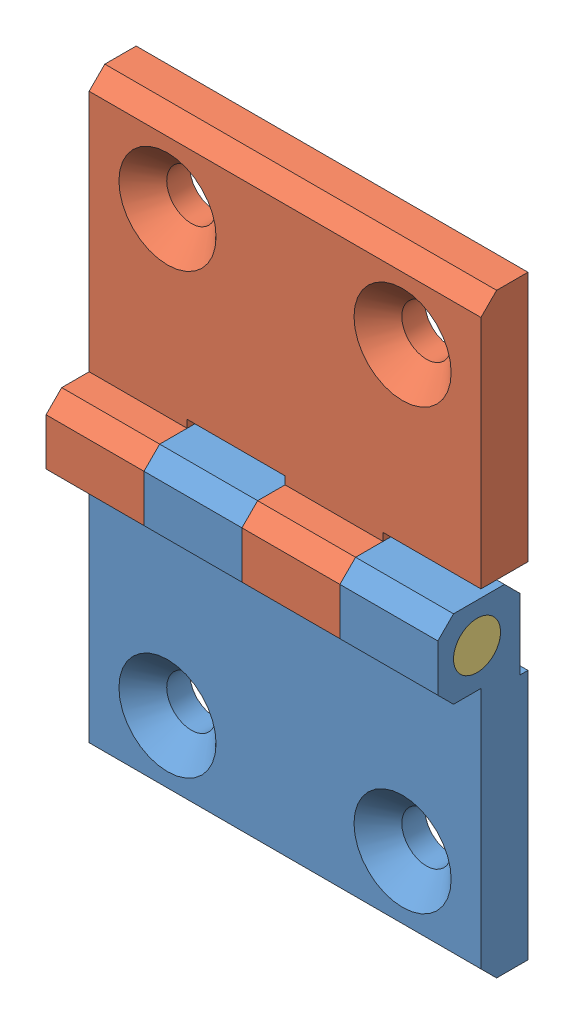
SolidWorks assembly FTH7650HC.sldasm, configuration Default (file format 15000). Lengths in mm.
Overall size (50 76 11.5).
3 component instances, 3 part files, 0 mates.
Components (placement in the parent):
- FTH7650HC_01-1: FTH7650HC_01.SLDPRT [Default] at origin size (50 43 11.5)
- FTH7650HC_02-1: FTH7650HC_02.SLDPRT [Default] at (30 56 0) x (-1 0 0) z (0 0 1) size (50 43 11.5)
- FTH7650HC_03-1: FTH7650HC_03.SLDPRT [Default] at (-10 28 6.5) x (0 0 -1) z (1 0 0) size (6 6 50)
